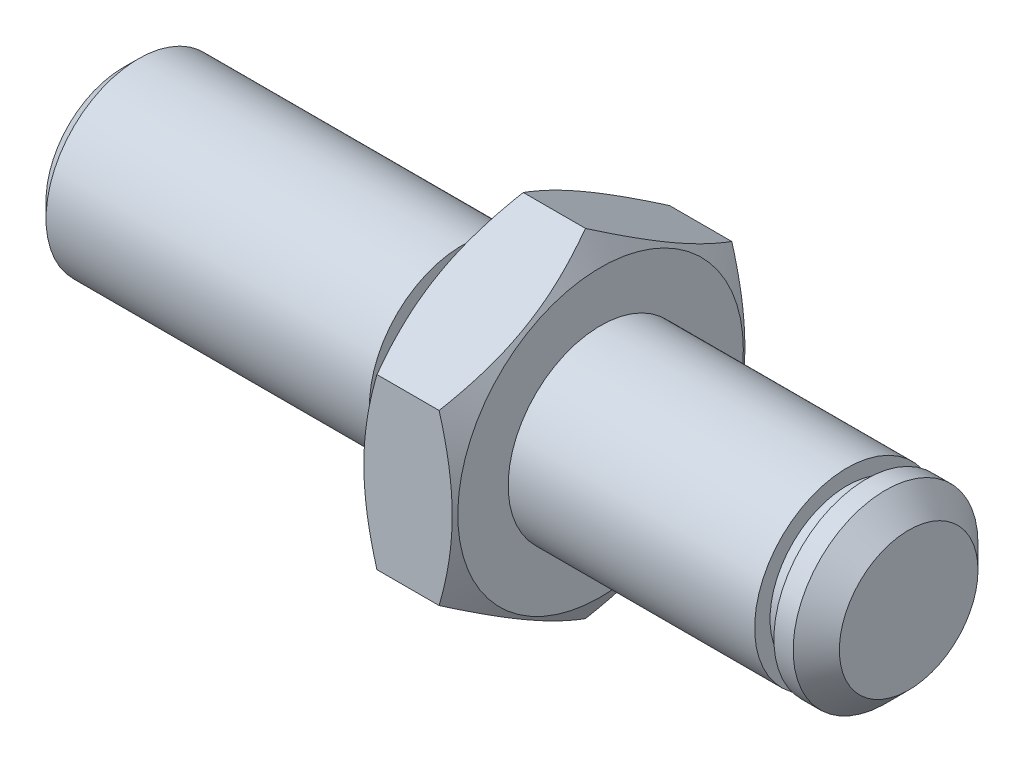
from build123d import *

# Parameters (mm, degrees)
ESQUISSE2_R             = 11
ENL_V_MAT_EXTRU_1_DEPTH = 35.684290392


with BuildPart() as part:
    # Esquisse1 → Base-R_volution (revolve)
    with BuildSketch(Plane.XY, mode=Mode.PRIVATE) as base_r_volution_sk:
        Polygon((1, 6), (22, 6), (22, 5), (25, 5), (25, 9.267949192), (26, 11), (30, 11), (31, 9.267949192), (31, 6), (47, 6), (47, 5), (48.25, 5), (48.25, 6), (49.5, 6), (51, 4.5), (51, 0), (0, 0), (0, 5), align=None)
    revolve(base_r_volution_sk.sketch.rotate(Axis((0, 0, 0), (-1, 0, 0)), 90), axis=Axis((0, 0, 0), (-1, 0, 0)))

    # Esquisse2 → Enl_v. mat.-Extru.1 (cut, through all)
    with BuildSketch(Plane(origin=(31, 0, 0), x_dir=(0, 0, -1), z_dir=(1, 0, 0))):
        Circle(ESQUISSE2_R)
        Polygon((9.5, -5.484827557), (9.5, 5.484827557), (0, 10.969655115), (-9.5, 5.484827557), (-9.5, -5.484827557), (0, -10.969655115), align=None, mode=Mode.SUBTRACT)
    extrude(amount=-ENL_V_MAT_EXTRU_1_DEPTH, mode=Mode.SUBTRACT)


solid = part.part
